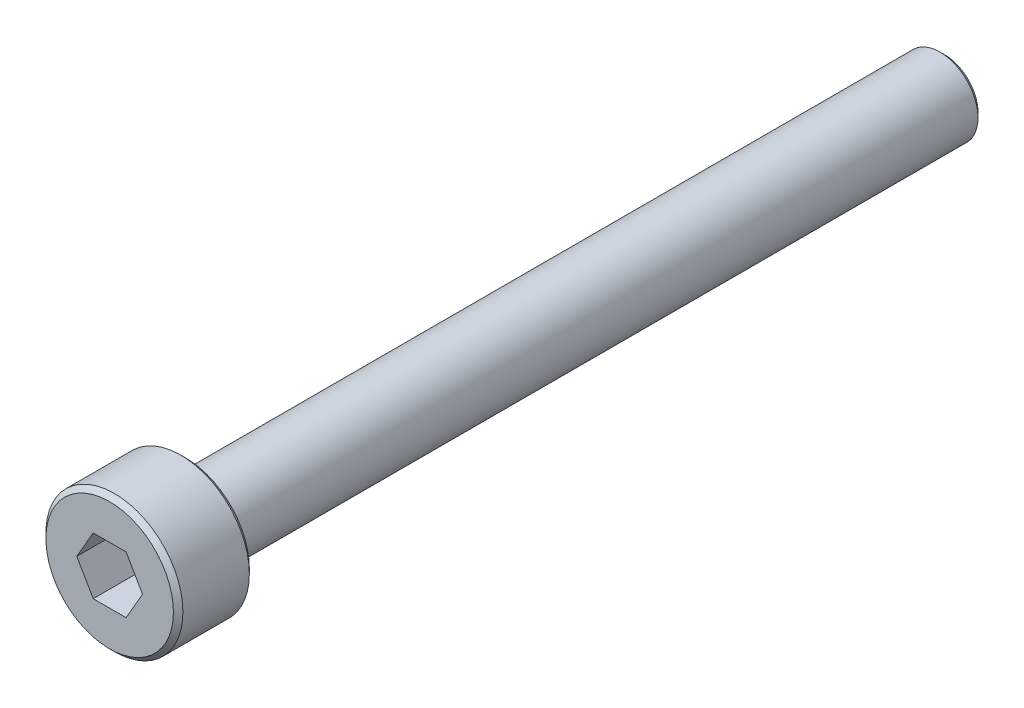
from build123d import *

# Parameters (mm, degrees)
SKETCH1_R           = 2
BOSS_EXTRUDE1_DEPTH = 40
SKETCH2_R           = 3.61
BOSS_EXTRUDE2_DEPTH = 4
CUT_EXTRUDE1_DEPTH  = 2.5
CHAMFER1_SIZE       = 0.25


with BuildPart() as part:
    # Sketch1 → Boss-Extrude1 (new body)
    with BuildSketch(Plane(origin=(0, 0, 0), x_dir=(0, 1, 0), z_dir=(0, 0, 1))):
        with Locations(Location((0, 0, 0), (0, 0, 270))):
            Circle(SKETCH1_R)
    extrude(amount=BOSS_EXTRUDE1_DEPTH)

    # Sketch2 → Boss-Extrude2 (add)
    with BuildSketch(Plane.XY.offset(40)):
        Circle(SKETCH2_R)
    extrude(amount=BOSS_EXTRUDE2_DEPTH)

    # Sketch3 → Cut-Extrude1 (cut)
    with BuildSketch(Plane.XY.offset(44)):
        Polygon((1.732050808, 0), (0.866025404, 1.5), (-0.866025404, 1.5), (-1.732050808, 0), (-0.866025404, -1.5), (0.866025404, -1.5), align=None)
    extrude(amount=-CUT_EXTRUDE1_DEPTH, mode=Mode.SUBTRACT)

    # Chamfer1
    chamfer1_edges = [part.edges().sort_by_distance(p)[0] for p in [
        (-2, 0, 0),
        (-3.61, 0, 40),
        (-3.61, 0, 44),
    ]]
    chamfer(chamfer1_edges, length=CHAMFER1_SIZE)


solid = part.part
